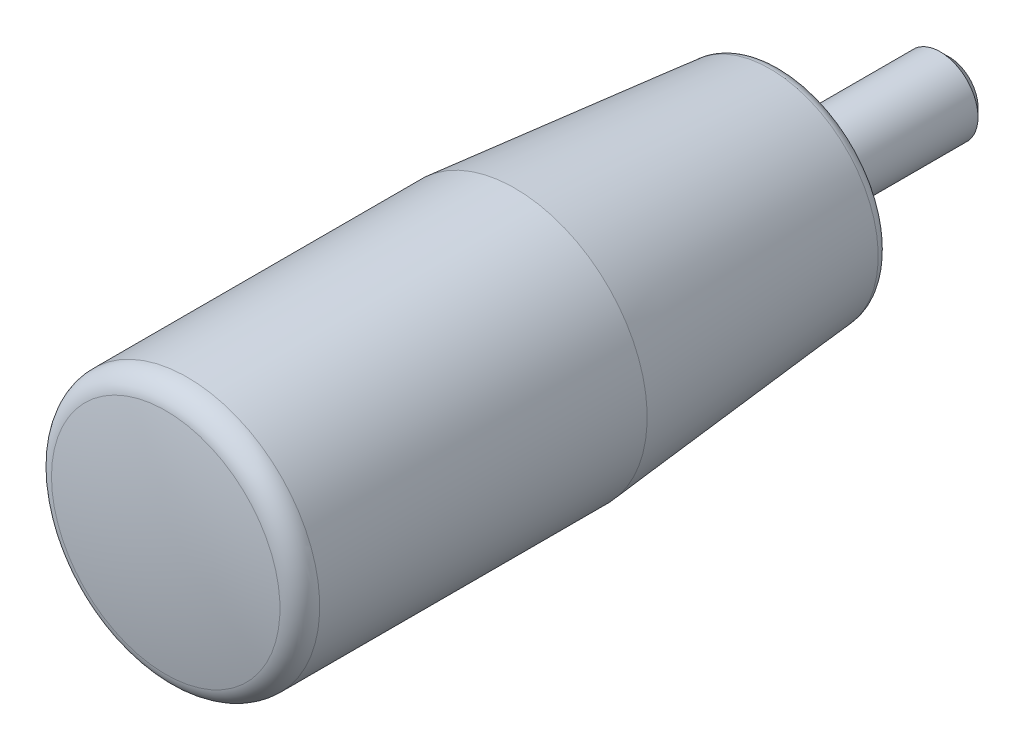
ISO-10303-21;
HEADER;
FILE_DESCRIPTION(('STEP AP214'),'2;1');
FILE_NAME('part.step','',(''),(''),'','','');
FILE_SCHEMA(('AUTOMOTIVE_DESIGN { 1 0 10303 214 1 1 1 1 }'));
ENDSEC;
DATA;
#1=APPLICATION_CONTEXT('core data for automotive mechanical design processes');
#2=APPLICATION_PROTOCOL_DEFINITION('international standard','automotive_design',2000,#1);
#3=PRODUCT_CONTEXT('',#1,'mechanical');
#4=PRODUCT('Part','Part','',(#3));
#5=PRODUCT_RELATED_PRODUCT_CATEGORY('part','',(#4));
#6=PRODUCT_DEFINITION_FORMATION('','',#4);
#7=PRODUCT_DEFINITION_CONTEXT('part definition',#1,'design');
#8=PRODUCT_DEFINITION('design','',#6,#7);
#9=PRODUCT_DEFINITION_SHAPE('','',#8);
#10=(LENGTH_UNIT() NAMED_UNIT(*) SI_UNIT(.MILLI.,.METRE.));
#11=(NAMED_UNIT(*) PLANE_ANGLE_UNIT() SI_UNIT($,.RADIAN.));
#12=(NAMED_UNIT(*) SI_UNIT($,.STERADIAN.) SOLID_ANGLE_UNIT());
#13=UNCERTAINTY_MEASURE_WITH_UNIT(LENGTH_MEASURE(1.E-05),#10,'distance_accuracy_value','');
#14=(GEOMETRIC_REPRESENTATION_CONTEXT(3) GLOBAL_UNCERTAINTY_ASSIGNED_CONTEXT((#13)) GLOBAL_UNIT_ASSIGNED_CONTEXT((#10,
#11,#12)) REPRESENTATION_CONTEXT('',''));
#15=CARTESIAN_POINT('',(0.,0.,0.));
#16=DIRECTION('',(0.,0.,1.));
#17=DIRECTION('',(1.,0.,0.));
#18=AXIS2_PLACEMENT_3D('',#15,#16,#17);
#19=CARTESIAN_POINT('',(0.,0.,47.449973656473));
#20=DIRECTION('',(0.,0.,-1.));
#21=DIRECTION('',(-1.,0.,0.));
#22=AXIS2_PLACEMENT_3D('',#19,#20,#21);
#23=TOROIDAL_SURFACE('',#22,8.75,1.75);
#24=CARTESIAN_POINT('',(0.,0.,47.449973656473));
#25=DIRECTION('',(0.,0.,-1.));
#26=DIRECTION('',(-1.,0.,0.));
#27=AXIS2_PLACEMENT_3D('',#24,#25,#26);
#28=CIRCLE('',#27,10.5);
#29=CARTESIAN_POINT('',(-10.5,0.,47.449973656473));
#30=VERTEX_POINT('',#29);
#31=EDGE_CURVE('E142',#30,#30,#28,.T.);
#32=ORIENTED_EDGE('',*,*,#31,.F.);
#33=EDGE_LOOP('',(#32));
#34=FACE_BOUND('',#33,.T.);
#35=CARTESIAN_POINT('',(0.,0.,49.1709571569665));
#36=DIRECTION('',(0.,0.,-1.));
#37=DIRECTION('',(-1.,0.,0.));
#38=AXIS2_PLACEMENT_3D('',#35,#36,#37);
#39=CIRCLE('',#38,9.06735751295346);
#40=CARTESIAN_POINT('',(-9.06735751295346,0.,49.1709571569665));
#41=VERTEX_POINT('',#40);
#42=EDGE_CURVE('E116',#41,#41,#39,.T.);
#43=ORIENTED_EDGE('',*,*,#42,.T.);
#44=EDGE_LOOP('',(#43));
#45=FACE_BOUND('',#44,.T.);
#46=ADVANCED_FACE('F14',(#34,#45),#23,.T.);
#47=CARTESIAN_POINT('',(0.,0.,-18.));
#48=DIRECTION('',(0.,0.,-1.));
#49=DIRECTION('',(-1.,0.,0.));
#50=AXIS2_PLACEMENT_3D('',#47,#48,#49);
#51=CYLINDRICAL_SURFACE('',#50,10.5);
#52=CARTESIAN_POINT('',(0.,0.,21.4577899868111));
#53=DIRECTION('',(0.,0.,-1.));
#54=DIRECTION('',(-1.,0.,0.));
#55=AXIS2_PLACEMENT_3D('',#52,#53,#54);
#56=CIRCLE('',#55,10.5);
#57=CARTESIAN_POINT('',(-10.5,0.,21.4577899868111));
#58=VERTEX_POINT('',#57);
#59=EDGE_CURVE('E139',#58,#58,#56,.T.);
#60=ORIENTED_EDGE('',*,*,#59,.F.);
#61=EDGE_LOOP('',(#60));
#62=FACE_BOUND('',#61,.T.);
#63=ORIENTED_EDGE('',*,*,#31,.T.);
#64=EDGE_LOOP('',(#63));
#65=FACE_BOUND('',#64,.T.);
#66=ADVANCED_FACE('F165',(#62,#65),#51,.T.);
#67=CARTESIAN_POINT('',(0.,0.,1.205891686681));
#68=DIRECTION('',(0.,0.,1.));
#69=DIRECTION('',(1.,0.,0.));
#70=AXIS2_PLACEMENT_3D('',#67,#68,#69);
#71=CONICAL_SURFACE('',#70,8.58563197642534,0.0942477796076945);
#72=ORIENTED_EDGE('',*,*,#59,.T.);
#73=EDGE_LOOP('',(#72));
#74=FACE_BOUND('',#73,.T.);
#75=CARTESIAN_POINT('',(0.,0.,1.205891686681));
#76=DIRECTION('',(0.,0.,-1.));
#77=DIRECTION('',(-1.,0.,0.));
#78=AXIS2_PLACEMENT_3D('',#75,#76,#77);
#79=CIRCLE('',#78,8.58563197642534);
#80=CARTESIAN_POINT('',(-8.58563197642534,0.,1.205891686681));
#81=VERTEX_POINT('',#80);
#82=EDGE_CURVE('E136',#81,#81,#79,.T.);
#83=ORIENTED_EDGE('',*,*,#82,.F.);
#84=EDGE_LOOP('',(#83));
#85=FACE_BOUND('',#84,.T.);
#86=ADVANCED_FACE('F171',(#74,#85),#71,.T.);
#87=CARTESIAN_POINT('',(0.,0.,1.2999999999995));
#88=DIRECTION('',(0.,0.,-1.));
#89=DIRECTION('',(-1.,0.,0.));
#90=AXIS2_PLACEMENT_3D('',#87,#88,#89);
#91=TOROIDAL_SURFACE('',#90,7.59007001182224,1.);
#92=CARTESIAN_POINT('',(0.,0.,0.299999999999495));
#93=DIRECTION('',(0.,0.,-1.));
#94=DIRECTION('',(-1.,0.,0.));
#95=AXIS2_PLACEMENT_3D('',#92,#93,#94);
#96=CIRCLE('',#95,7.59007001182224);
#97=CARTESIAN_POINT('',(-7.59007001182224,0.,0.299999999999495));
#98=VERTEX_POINT('',#97);
#99=EDGE_CURVE('E133',#98,#98,#96,.T.);
#100=ORIENTED_EDGE('',*,*,#99,.F.);
#101=EDGE_LOOP('',(#100));
#102=FACE_BOUND('',#101,.T.);
#103=ORIENTED_EDGE('',*,*,#82,.T.);
#104=EDGE_LOOP('',(#103));
#105=FACE_BOUND('',#104,.T.);
#106=ADVANCED_FACE('F179',(#102,#105),#91,.T.);
#107=CARTESIAN_POINT('',(0.,5.,0.299999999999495));
#108=DIRECTION('',(0.,0.,-1.));
#109=DIRECTION('',(-1.,0.,0.));
#110=AXIS2_PLACEMENT_3D('',#107,#108,#109);
#111=PLANE('',#110);
#112=ORIENTED_EDGE('',*,*,#99,.T.);
#113=EDGE_LOOP('',(#112));
#114=FACE_BOUND('',#113,.T.);
#115=CARTESIAN_POINT('',(0.,0.,0.299999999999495));
#116=DIRECTION('',(0.,0.,-1.));
#117=DIRECTION('',(-1.,0.,0.));
#118=AXIS2_PLACEMENT_3D('',#115,#116,#117);
#119=CIRCLE('',#118,5.);
#120=CARTESIAN_POINT('',(-5.,0.,0.299999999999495));
#121=VERTEX_POINT('',#120);
#122=EDGE_CURVE('E130',#121,#121,#119,.T.);
#123=ORIENTED_EDGE('',*,*,#122,.F.);
#124=EDGE_LOOP('',(#123));
#125=FACE_BOUND('',#124,.T.);
#126=ADVANCED_FACE('F183',(#114,#125),#111,.T.);
#127=CARTESIAN_POINT('',(0.,0.,-18.));
#128=DIRECTION('',(0.,0.,-1.));
#129=DIRECTION('',(-1.,0.,0.));
#130=AXIS2_PLACEMENT_3D('',#127,#128,#129);
#131=CYLINDRICAL_SURFACE('',#130,5.);
#132=ORIENTED_EDGE('',*,*,#122,.T.);
#133=EDGE_LOOP('',(#132));
#134=FACE_BOUND('',#133,.T.);
#135=CARTESIAN_POINT('',(0.,0.,0.));
#136=DIRECTION('',(0.,0.,-1.));
#137=DIRECTION('',(-1.,0.,0.));
#138=AXIS2_PLACEMENT_3D('',#135,#136,#137);
#139=CIRCLE('',#138,5.);
#140=CARTESIAN_POINT('',(-5.,0.,0.));
#141=VERTEX_POINT('',#140);
#142=EDGE_CURVE('E127',#141,#141,#139,.T.);
#143=ORIENTED_EDGE('',*,*,#142,.F.);
#144=EDGE_LOOP('',(#143));
#145=FACE_BOUND('',#144,.T.);
#146=ADVANCED_FACE('F187',(#134,#145),#131,.T.);
#147=CARTESIAN_POINT('',(0.,5.,0.));
#148=DIRECTION('',(0.,0.,1.));
#149=DIRECTION('',(1.,0.,0.));
#150=AXIS2_PLACEMENT_3D('',#147,#148,#149);
#151=PLANE('',#150);
#152=CARTESIAN_POINT('',(0.,0.,0.));
#153=DIRECTION('',(0.,0.,-1.));
#154=DIRECTION('',(-1.,0.,0.));
#155=AXIS2_PLACEMENT_3D('',#152,#153,#154);
#156=CIRCLE('',#155,3.);
#157=CARTESIAN_POINT('',(-3.,0.,0.));
#158=VERTEX_POINT('',#157);
#159=EDGE_CURVE('E124',#158,#158,#156,.T.);
#160=ORIENTED_EDGE('',*,*,#159,.F.);
#161=EDGE_LOOP('',(#160));
#162=FACE_BOUND('',#161,.T.);
#163=ORIENTED_EDGE('',*,*,#142,.T.);
#164=EDGE_LOOP('',(#163));
#165=FACE_BOUND('',#164,.T.);
#166=ADVANCED_FACE('F191',(#162,#165),#151,.F.);
#167=CARTESIAN_POINT('',(0.,0.,-18.));
#168=DIRECTION('',(0.,0.,-1.));
#169=DIRECTION('',(-1.,0.,0.));
#170=AXIS2_PLACEMENT_3D('',#167,#168,#169);
#171=CYLINDRICAL_SURFACE('',#170,3.);
#172=CARTESIAN_POINT('',(0.,0.,-12.3000000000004));
#173=DIRECTION('',(0.,0.,1.));
#174=DIRECTION('',(1.,0.,0.));
#175=AXIS2_PLACEMENT_3D('',#172,#173,#174);
#176=CIRCLE('',#175,3.);
#177=CARTESIAN_POINT('',(3.,0.,-12.3000000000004));
#178=VERTEX_POINT('',#177);
#179=EDGE_CURVE('E9',#178,#178,#176,.T.);
#180=ORIENTED_EDGE('',*,*,#179,.T.);
#181=EDGE_LOOP('',(#180));
#182=FACE_BOUND('',#181,.T.);
#183=ORIENTED_EDGE('',*,*,#159,.T.);
#184=EDGE_LOOP('',(#183));
#185=FACE_BOUND('',#184,.T.);
#186=ADVANCED_FACE('F195',(#182,#185),#171,.T.);
#187=CARTESIAN_POINT('',(0.,3.,-13.0000000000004));
#188=DIRECTION('',(0.,0.,1.));
#189=DIRECTION('',(1.,0.,0.));
#190=AXIS2_PLACEMENT_3D('',#187,#188,#189);
#191=PLANE('',#190);
#192=DIRECTION('',(-0.866025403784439,0.5,0.));
#193=VECTOR('',#192,1.);
#194=CARTESIAN_POINT('',(0.,-1.73205080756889,-13.0000000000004));
#195=LINE('',#194,#193);
#196=CARTESIAN_POINT('',(0.,-1.73205080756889,-13.0000000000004));
#197=VERTEX_POINT('',#196);
#198=CARTESIAN_POINT('',(-1.5,-0.866025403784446,-13.0000000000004));
#199=VERTEX_POINT('',#198);
#200=EDGE_CURVE('E103',#197,#199,#195,.T.);
#201=ORIENTED_EDGE('',*,*,#200,.F.);
#202=DIRECTION('',(-0.866025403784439,-0.5,0.));
#203=VECTOR('',#202,1.);
#204=CARTESIAN_POINT('',(1.5,-0.866025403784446,-13.0000000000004));
#205=LINE('',#204,#203);
#206=CARTESIAN_POINT('',(1.5,-0.866025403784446,-13.0000000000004));
#207=VERTEX_POINT('',#206);
#208=EDGE_CURVE('E29',#207,#197,#205,.T.);
#209=ORIENTED_EDGE('',*,*,#208,.F.);
#210=DIRECTION('',(0.,-1.,0.));
#211=VECTOR('',#210,1.);
#212=CARTESIAN_POINT('',(1.5,0.866025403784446,-13.0000000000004));
#213=LINE('',#212,#211);
#214=CARTESIAN_POINT('',(1.5,0.866025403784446,-13.0000000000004));
#215=VERTEX_POINT('',#214);
#216=EDGE_CURVE('E112',#215,#207,#213,.T.);
#217=ORIENTED_EDGE('',*,*,#216,.F.);
#218=DIRECTION('',(0.866025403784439,-0.5,0.));
#219=VECTOR('',#218,1.);
#220=CARTESIAN_POINT('',(0.,1.73205080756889,-13.0000000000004));
#221=LINE('',#220,#219);
#222=CARTESIAN_POINT('',(0.,1.73205080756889,-13.0000000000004));
#223=VERTEX_POINT('',#222);
#224=EDGE_CURVE('E110',#223,#215,#221,.T.);
#225=ORIENTED_EDGE('',*,*,#224,.F.);
#226=DIRECTION('',(0.866025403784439,0.5,0.));
#227=VECTOR('',#226,1.);
#228=CARTESIAN_POINT('',(-1.5,0.866025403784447,-13.0000000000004));
#229=LINE('',#228,#227);
#230=CARTESIAN_POINT('',(-1.5,0.866025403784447,-13.0000000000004));
#231=VERTEX_POINT('',#230);
#232=EDGE_CURVE('E77',#231,#223,#229,.T.);
#233=ORIENTED_EDGE('',*,*,#232,.F.);
#234=DIRECTION('',(0.,1.,0.));
#235=VECTOR('',#234,1.);
#236=CARTESIAN_POINT('',(-1.5,-0.866025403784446,-13.0000000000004));
#237=LINE('',#236,#235);
#238=EDGE_CURVE('E106',#199,#231,#237,.T.);
#239=ORIENTED_EDGE('',*,*,#238,.F.);
#240=EDGE_LOOP('',(#201,#209,#217,#225,#233,#239));
#241=FACE_BOUND('',#240,.T.);
#242=CARTESIAN_POINT('',(0.,0.,-13.0000000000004));
#243=DIRECTION('',(0.,0.,1.));
#244=DIRECTION('',(1.,0.,0.));
#245=AXIS2_PLACEMENT_3D('',#242,#243,#244);
#246=CIRCLE('',#245,2.3);
#247=CARTESIAN_POINT('',(2.3,0.,-13.0000000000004));
#248=VERTEX_POINT('',#247);
#249=EDGE_CURVE('E22',#248,#248,#246,.F.);
#250=ORIENTED_EDGE('',*,*,#249,.T.);
#251=EDGE_LOOP('',(#250));
#252=FACE_BOUND('',#251,.T.);
#253=ADVANCED_FACE('F147',(#241,#252),#191,.F.);
#254=CARTESIAN_POINT('',(0.,0.,-4.9960036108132E-13));
#255=DIRECTION('',(-1.,0.,0.));
#256=DIRECTION('',(0.,0.,1.));
#257=AXIS2_PLACEMENT_3D('',#254,#255,#256);
#258=SPHERICAL_SURFACE('',#257,50.);
#259=CARTESIAN_POINT('',(0.,0.,-4.9960036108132E-13));
#260=DIRECTION('',(0.,0.,-1.));
#261=DIRECTION('',(-1.,0.,0.));
#262=AXIS2_PLACEMENT_3D('',#259,#260,#261);
#263=SPHERICAL_SURFACE('',#262,50.);
#264=ORIENTED_EDGE('',*,*,#42,.F.);
#265=EDGE_LOOP('',(#264));
#266=FACE_BOUND('',#265,.T.);
#267=ADVANCED_FACE('F151',(#266),#263,.T.);
#268=CARTESIAN_POINT('',(0.,0.,-13.0000000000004));
#269=DIRECTION('',(0.,0.,1.));
#270=DIRECTION('',(1.,0.,0.));
#271=AXIS2_PLACEMENT_3D('',#268,#269,#270);
#272=CONICAL_SURFACE('',#271,2.3,0.785398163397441);
#273=ORIENTED_EDGE('',*,*,#179,.F.);
#274=EDGE_LOOP('',(#273));
#275=FACE_BOUND('',#274,.T.);
#276=ORIENTED_EDGE('',*,*,#249,.F.);
#277=EDGE_LOOP('',(#276));
#278=FACE_BOUND('',#277,.T.);
#279=ADVANCED_FACE('F16',(#275,#278),#272,.T.);
#280=CARTESIAN_POINT('',(1.5,-0.866025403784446,-9.0000000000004));
#281=DIRECTION('',(0.5,-0.866025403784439,0.));
#282=DIRECTION('',(0.866025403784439,0.5,0.));
#283=AXIS2_PLACEMENT_3D('',#280,#281,#282);
#284=PLANE('',#283);
#285=ORIENTED_EDGE('',*,*,#208,.T.);
#286=DIRECTION('',(0.,0.,-1.));
#287=VECTOR('',#286,1.);
#288=CARTESIAN_POINT('',(0.,-1.73205080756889,-9.0000000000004));
#289=LINE('',#288,#287);
#290=CARTESIAN_POINT('',(0.,-1.73205080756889,-9.0000000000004));
#291=VERTEX_POINT('',#290);
#292=EDGE_CURVE('E59',#291,#197,#289,.T.);
#293=ORIENTED_EDGE('',*,*,#292,.F.);
#294=DIRECTION('',(-0.866025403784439,-0.5,0.));
#295=VECTOR('',#294,1.);
#296=CARTESIAN_POINT('',(1.5,-0.866025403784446,-9.0000000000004));
#297=LINE('',#296,#295);
#298=CARTESIAN_POINT('',(1.5,-0.866025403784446,-9.0000000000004));
#299=VERTEX_POINT('',#298);
#300=EDGE_CURVE('E114',#299,#291,#297,.T.);
#301=ORIENTED_EDGE('',*,*,#300,.F.);
#302=DIRECTION('',(0.,0.,-1.));
#303=VECTOR('',#302,1.);
#304=CARTESIAN_POINT('',(1.5,-0.866025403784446,-9.0000000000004));
#305=LINE('',#304,#303);
#306=EDGE_CURVE('E37',#299,#207,#305,.T.);
#307=ORIENTED_EDGE('',*,*,#306,.T.);
#308=EDGE_LOOP('',(#285,#293,#301,#307));
#309=FACE_BOUND('',#308,.T.);
#310=ADVANCED_FACE('F150',(#309),#284,.F.);
#311=CARTESIAN_POINT('',(1.5,0.866025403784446,-9.0000000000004));
#312=DIRECTION('',(1.,0.,0.));
#313=DIRECTION('',(0.,0.,-1.));
#314=AXIS2_PLACEMENT_3D('',#311,#312,#313);
#315=PLANE('',#314);
#316=ORIENTED_EDGE('',*,*,#216,.T.);
#317=ORIENTED_EDGE('',*,*,#306,.F.);
#318=DIRECTION('',(0.,-1.,0.));
#319=VECTOR('',#318,1.);
#320=CARTESIAN_POINT('',(1.5,0.866025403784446,-9.0000000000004));
#321=LINE('',#320,#319);
#322=CARTESIAN_POINT('',(1.5,0.866025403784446,-9.0000000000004));
#323=VERTEX_POINT('',#322);
#324=EDGE_CURVE('E89',#323,#299,#321,.T.);
#325=ORIENTED_EDGE('',*,*,#324,.F.);
#326=DIRECTION('',(0.,0.,-1.));
#327=VECTOR('',#326,1.);
#328=CARTESIAN_POINT('',(1.5,0.866025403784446,-9.0000000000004));
#329=LINE('',#328,#327);
#330=EDGE_CURVE('E81',#323,#215,#329,.T.);
#331=ORIENTED_EDGE('',*,*,#330,.T.);
#332=EDGE_LOOP('',(#316,#317,#325,#331));
#333=FACE_BOUND('',#332,.T.);
#334=ADVANCED_FACE('F159',(#333),#315,.F.);
#335=CARTESIAN_POINT('',(0.,1.73205080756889,-9.0000000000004));
#336=DIRECTION('',(0.5,0.866025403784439,0.));
#337=DIRECTION('',(-0.866025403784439,0.5,0.));
#338=AXIS2_PLACEMENT_3D('',#335,#336,#337);
#339=PLANE('',#338);
#340=ORIENTED_EDGE('',*,*,#224,.T.);
#341=ORIENTED_EDGE('',*,*,#330,.F.);
#342=DIRECTION('',(0.866025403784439,-0.5,0.));
#343=VECTOR('',#342,1.);
#344=CARTESIAN_POINT('',(0.,1.73205080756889,-9.0000000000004));
#345=LINE('',#344,#343);
#346=CARTESIAN_POINT('',(0.,1.73205080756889,-9.0000000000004));
#347=VERTEX_POINT('',#346);
#348=EDGE_CURVE('E85',#347,#323,#345,.T.);
#349=ORIENTED_EDGE('',*,*,#348,.F.);
#350=DIRECTION('',(0.,0.,-1.));
#351=VECTOR('',#350,1.);
#352=CARTESIAN_POINT('',(0.,1.73205080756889,-9.0000000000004));
#353=LINE('',#352,#351);
#354=EDGE_CURVE('E70',#347,#223,#353,.T.);
#355=ORIENTED_EDGE('',*,*,#354,.T.);
#356=EDGE_LOOP('',(#340,#341,#349,#355));
#357=FACE_BOUND('',#356,.T.);
#358=ADVANCED_FACE('F86',(#357),#339,.F.);
#359=CARTESIAN_POINT('',(-1.5,0.866025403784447,-9.0000000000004));
#360=DIRECTION('',(-0.5,0.866025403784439,0.));
#361=DIRECTION('',(-0.866025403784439,-0.5,0.));
#362=AXIS2_PLACEMENT_3D('',#359,#360,#361);
#363=PLANE('',#362);
#364=ORIENTED_EDGE('',*,*,#232,.T.);
#365=ORIENTED_EDGE('',*,*,#354,.F.);
#366=DIRECTION('',(0.866025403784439,0.5,0.));
#367=VECTOR('',#366,1.);
#368=CARTESIAN_POINT('',(-1.5,0.866025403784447,-9.0000000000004));
#369=LINE('',#368,#367);
#370=CARTESIAN_POINT('',(-1.5,0.866025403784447,-9.0000000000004));
#371=VERTEX_POINT('',#370);
#372=EDGE_CURVE('E74',#371,#347,#369,.T.);
#373=ORIENTED_EDGE('',*,*,#372,.F.);
#374=DIRECTION('',(0.,0.,-1.));
#375=VECTOR('',#374,1.);
#376=CARTESIAN_POINT('',(-1.5,0.866025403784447,-9.0000000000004));
#377=LINE('',#376,#375);
#378=EDGE_CURVE('E82',#371,#231,#377,.T.);
#379=ORIENTED_EDGE('',*,*,#378,.T.);
#380=EDGE_LOOP('',(#364,#365,#373,#379));
#381=FACE_BOUND('',#380,.T.);
#382=ADVANCED_FACE('F72',(#381),#363,.F.);
#383=CARTESIAN_POINT('',(-1.5,-0.866025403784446,-9.0000000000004));
#384=DIRECTION('',(-1.,0.,0.));
#385=DIRECTION('',(0.,-1.,0.));
#386=AXIS2_PLACEMENT_3D('',#383,#384,#385);
#387=PLANE('',#386);
#388=ORIENTED_EDGE('',*,*,#238,.T.);
#389=ORIENTED_EDGE('',*,*,#378,.F.);
#390=DIRECTION('',(0.,1.,0.));
#391=VECTOR('',#390,1.);
#392=CARTESIAN_POINT('',(-1.5,-0.866025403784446,-9.0000000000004));
#393=LINE('',#392,#391);
#394=CARTESIAN_POINT('',(-1.5,-0.866025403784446,-9.0000000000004));
#395=VERTEX_POINT('',#394);
#396=EDGE_CURVE('E95',#395,#371,#393,.T.);
#397=ORIENTED_EDGE('',*,*,#396,.F.);
#398=DIRECTION('',(0.,0.,-1.));
#399=VECTOR('',#398,1.);
#400=CARTESIAN_POINT('',(-1.5,-0.866025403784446,-9.0000000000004));
#401=LINE('',#400,#399);
#402=EDGE_CURVE('E119',#395,#199,#401,.T.);
#403=ORIENTED_EDGE('',*,*,#402,.T.);
#404=EDGE_LOOP('',(#388,#389,#397,#403));
#405=FACE_BOUND('',#404,.T.);
#406=ADVANCED_FACE('F206',(#405),#387,.F.);
#407=CARTESIAN_POINT('',(0.,-1.73205080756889,-9.0000000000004));
#408=DIRECTION('',(-0.5,-0.866025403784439,0.));
#409=DIRECTION('',(0.866025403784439,-0.5,0.));
#410=AXIS2_PLACEMENT_3D('',#407,#408,#409);
#411=PLANE('',#410);
#412=ORIENTED_EDGE('',*,*,#200,.T.);
#413=ORIENTED_EDGE('',*,*,#402,.F.);
#414=DIRECTION('',(-0.866025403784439,0.5,0.));
#415=VECTOR('',#414,1.);
#416=CARTESIAN_POINT('',(0.,-1.73205080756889,-9.0000000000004));
#417=LINE('',#416,#415);
#418=EDGE_CURVE('E97',#291,#395,#417,.T.);
#419=ORIENTED_EDGE('',*,*,#418,.F.);
#420=ORIENTED_EDGE('',*,*,#292,.T.);
#421=EDGE_LOOP('',(#412,#413,#419,#420));
#422=FACE_BOUND('',#421,.T.);
#423=ADVANCED_FACE('F203',(#422),#411,.F.);
#424=CARTESIAN_POINT('',(0.,-1.73205080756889,-9.0000000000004));
#425=DIRECTION('',(0.,0.,-1.));
#426=DIRECTION('',(-1.,0.,0.));
#427=AXIS2_PLACEMENT_3D('',#424,#425,#426);
#428=PLANE('',#427);
#429=ORIENTED_EDGE('',*,*,#300,.T.);
#430=ORIENTED_EDGE('',*,*,#418,.T.);
#431=ORIENTED_EDGE('',*,*,#396,.T.);
#432=ORIENTED_EDGE('',*,*,#372,.T.);
#433=ORIENTED_EDGE('',*,*,#348,.T.);
#434=ORIENTED_EDGE('',*,*,#324,.T.);
#435=EDGE_LOOP('',(#429,#430,#431,#432,#433,#434));
#436=FACE_BOUND('',#435,.T.);
#437=ADVANCED_FACE('F92',(#436),#428,.T.);
#438=CLOSED_SHELL('',(#46,#66,#86,#106,#126,#146,#166,#186,#253,#267,#279,#310,#334,#358,#382,
#406,#423,#437));
#439=MANIFOLD_SOLID_BREP('B1',#438);
#440=ADVANCED_BREP_SHAPE_REPRESENTATION('',(#18,#439),#14);
#441=SHAPE_DEFINITION_REPRESENTATION(#9,#440);
ENDSEC;
END-ISO-10303-21;
